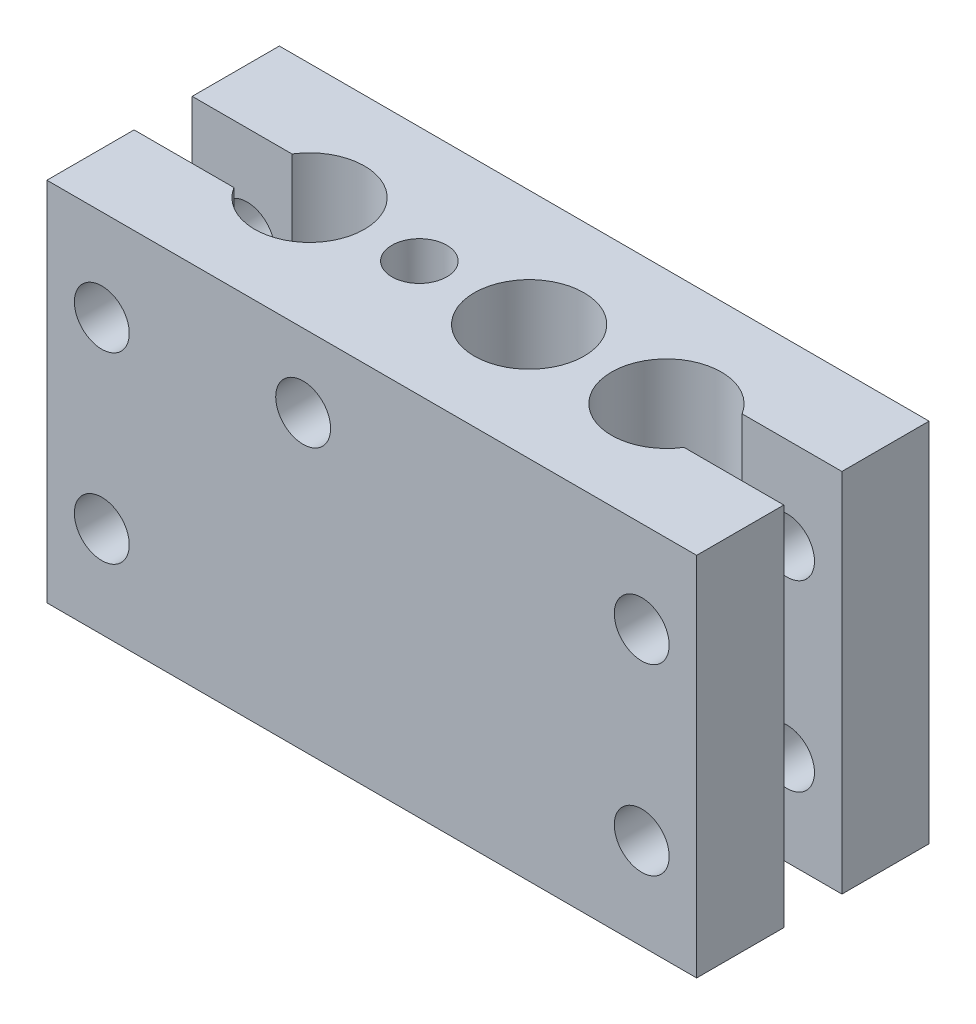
ISO-10303-21;
HEADER;
FILE_DESCRIPTION(('STEP AP214'),'2;1');
FILE_NAME('part.step','',(''),(''),'','','');
FILE_SCHEMA(('AUTOMOTIVE_DESIGN { 1 0 10303 214 1 1 1 1 }'));
ENDSEC;
DATA;
#1=APPLICATION_CONTEXT('core data for automotive mechanical design processes');
#2=APPLICATION_PROTOCOL_DEFINITION('international standard','automotive_design',2000,#1);
#3=PRODUCT_CONTEXT('',#1,'mechanical');
#4=PRODUCT('Part','Part','',(#3));
#5=PRODUCT_RELATED_PRODUCT_CATEGORY('part','',(#4));
#6=PRODUCT_DEFINITION_FORMATION('','',#4);
#7=PRODUCT_DEFINITION_CONTEXT('part definition',#1,'design');
#8=PRODUCT_DEFINITION('design','',#6,#7);
#9=PRODUCT_DEFINITION_SHAPE('','',#8);
#10=(LENGTH_UNIT() NAMED_UNIT(*) SI_UNIT(.MILLI.,.METRE.));
#11=(NAMED_UNIT(*) PLANE_ANGLE_UNIT() SI_UNIT($,.RADIAN.));
#12=(NAMED_UNIT(*) SI_UNIT($,.STERADIAN.) SOLID_ANGLE_UNIT());
#13=UNCERTAINTY_MEASURE_WITH_UNIT(LENGTH_MEASURE(1.E-05),#10,'distance_accuracy_value','');
#14=(GEOMETRIC_REPRESENTATION_CONTEXT(3) GLOBAL_UNCERTAINTY_ASSIGNED_CONTEXT((#13)) GLOBAL_UNIT_ASSIGNED_CONTEXT((#10,
#11,#12)) REPRESENTATION_CONTEXT('',''));
#15=CARTESIAN_POINT('',(0.,0.,0.));
#16=DIRECTION('',(0.,0.,1.));
#17=DIRECTION('',(1.,0.,0.));
#18=AXIS2_PLACEMENT_3D('',#15,#16,#17);
#19=CARTESIAN_POINT('',(-3.75,-10.,0.));
#20=DIRECTION('',(0.,1.,0.));
#21=DIRECTION('',(0.,0.,1.));
#22=AXIS2_PLACEMENT_3D('',#19,#20,#21);
#23=CYLINDRICAL_SURFACE('',#22,1.5);
#24=CARTESIAN_POINT('',(-3.75,10.,0.));
#25=DIRECTION('',(0.,-1.,0.));
#26=DIRECTION('',(0.,0.,-1.));
#27=AXIS2_PLACEMENT_3D('',#24,#25,#26);
#28=CIRCLE('',#27,1.5);
#29=CARTESIAN_POINT('',(-3.75,10.,-1.5));
#30=VERTEX_POINT('',#29);
#31=EDGE_CURVE('E341',#30,#30,#28,.T.);
#32=ORIENTED_EDGE('',*,*,#31,.F.);
#33=EDGE_LOOP('',(#32));
#34=FACE_BOUND('',#33,.T.);
#35=CARTESIAN_POINT('',(-3.75,6.,0.));
#36=DIRECTION('',(0.,0.707106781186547,-0.707106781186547));
#37=DIRECTION('',(0.,0.707106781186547,0.707106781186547));
#38=AXIS2_PLACEMENT_3D('',#35,#36,#37);
#39=ELLIPSE('',#38,2.12132034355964,1.5);
#40=CARTESIAN_POINT('',(-2.25,6.,0.));
#41=VERTEX_POINT('',#40);
#42=CARTESIAN_POINT('',(-5.24999999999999,6.,0.));
#43=VERTEX_POINT('',#42);
#44=EDGE_CURVE('E202',#41,#43,#39,.F.);
#45=ORIENTED_EDGE('',*,*,#44,.T.);
#46=CARTESIAN_POINT('',(-3.75,6.,0.));
#47=DIRECTION('',(0.,0.707106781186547,0.707106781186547));
#48=DIRECTION('',(0.,0.707106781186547,-0.707106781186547));
#49=AXIS2_PLACEMENT_3D('',#46,#47,#48);
#50=ELLIPSE('',#49,2.12132034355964,1.5);
#51=EDGE_CURVE('E12',#43,#41,#50,.F.);
#52=ORIENTED_EDGE('',*,*,#51,.T.);
#53=EDGE_LOOP('',(#45,#52));
#54=FACE_BOUND('',#53,.T.);
#55=ADVANCED_FACE('F189',(#34,#54),#23,.F.);
#56=CARTESIAN_POINT('',(17.75,-10.,6.35));
#57=DIRECTION('',(-1.,0.,0.));
#58=DIRECTION('',(0.,0.,1.));
#59=AXIS2_PLACEMENT_3D('',#56,#57,#58);
#60=PLANE('',#59);
#61=DIRECTION('',(0.,1.,0.));
#62=VECTOR('',#61,1.);
#63=CARTESIAN_POINT('',(17.75,-10.,-1.5875));
#64=LINE('',#63,#62);
#65=CARTESIAN_POINT('',(17.75,-10.,-1.5875));
#66=VERTEX_POINT('',#65);
#67=CARTESIAN_POINT('',(17.75,10.,-1.5875));
#68=VERTEX_POINT('',#67);
#69=EDGE_CURVE('E293',#66,#68,#64,.T.);
#70=ORIENTED_EDGE('',*,*,#69,.F.);
#71=DIRECTION('',(0.,0.,-1.));
#72=VECTOR('',#71,1.);
#73=CARTESIAN_POINT('',(17.75,-10.,6.35));
#74=LINE('',#73,#72);
#75=CARTESIAN_POINT('',(17.75,-10.,-6.35));
#76=VERTEX_POINT('',#75);
#77=EDGE_CURVE('E287',#66,#76,#74,.T.);
#78=ORIENTED_EDGE('',*,*,#77,.T.);
#79=DIRECTION('',(0.,1.,0.));
#80=VECTOR('',#79,1.);
#81=CARTESIAN_POINT('',(17.75,-10.,-6.35));
#82=LINE('',#81,#80);
#83=CARTESIAN_POINT('',(17.75,10.,-6.35));
#84=VERTEX_POINT('',#83);
#85=EDGE_CURVE('E292',#76,#84,#82,.T.);
#86=ORIENTED_EDGE('',*,*,#85,.T.);
#87=DIRECTION('',(0.,0.,-1.));
#88=VECTOR('',#87,1.);
#89=CARTESIAN_POINT('',(17.75,10.,6.35));
#90=LINE('',#89,#88);
#91=EDGE_CURVE('E333',#68,#84,#90,.T.);
#92=ORIENTED_EDGE('',*,*,#91,.F.);
#93=EDGE_LOOP('',(#70,#78,#86,#92));
#94=FACE_BOUND('',#93,.T.);
#95=ADVANCED_FACE('F289',(#94),#60,.F.);
#96=CARTESIAN_POINT('',(-17.75,10.,6.35));
#97=DIRECTION('',(0.,-1.,0.));
#98=DIRECTION('',(0.,0.,-1.));
#99=AXIS2_PLACEMENT_3D('',#96,#97,#98);
#100=PLANE('',#99);
#101=CARTESIAN_POINT('',(2.25,10.,0.));
#102=DIRECTION('',(0.,-1.,0.));
#103=DIRECTION('',(0.,0.,-1.));
#104=AXIS2_PLACEMENT_3D('',#101,#102,#103);
#105=CIRCLE('',#104,3.);
#106=CARTESIAN_POINT('',(2.25,10.,-3.));
#107=VERTEX_POINT('',#106);
#108=EDGE_CURVE('E436',#107,#107,#105,.T.);
#109=ORIENTED_EDGE('',*,*,#108,.T.);
#110=EDGE_LOOP('',(#109));
#111=FACE_BOUND('',#110,.T.);
#112=ORIENTED_EDGE('',*,*,#31,.T.);
#113=EDGE_LOOP('',(#112));
#114=FACE_BOUND('',#113,.T.);
#115=DIRECTION('',(-1.,0.,0.));
#116=VECTOR('',#115,1.);
#117=CARTESIAN_POINT('',(-17.75,10.,-1.5875));
#118=LINE('',#117,#116);
#119=CARTESIAN_POINT('',(12.2955537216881,10.,-1.5875));
#120=VERTEX_POINT('',#119);
#121=EDGE_CURVE('E315',#68,#120,#118,.T.);
#122=ORIENTED_EDGE('',*,*,#121,.F.);
#123=ORIENTED_EDGE('',*,*,#91,.T.);
#124=DIRECTION('',(-1.,0.,0.));
#125=VECTOR('',#124,1.);
#126=CARTESIAN_POINT('',(-17.75,10.,-6.35));
#127=LINE('',#126,#125);
#128=CARTESIAN_POINT('',(-17.75,10.,-6.35));
#129=VERTEX_POINT('',#128);
#130=EDGE_CURVE('E314',#84,#129,#127,.T.);
#131=ORIENTED_EDGE('',*,*,#130,.T.);
#132=DIRECTION('',(0.,0.,-1.));
#133=VECTOR('',#132,1.);
#134=CARTESIAN_POINT('',(-17.75,10.,6.35));
#135=LINE('',#134,#133);
#136=CARTESIAN_POINT('',(-17.75,10.,-1.5875));
#137=VERTEX_POINT('',#136);
#138=EDGE_CURVE('E329',#137,#129,#135,.T.);
#139=ORIENTED_EDGE('',*,*,#138,.F.);
#140=DIRECTION('',(1.,0.,0.));
#141=VECTOR('',#140,1.);
#142=CARTESIAN_POINT('',(-17.75,10.,-1.5875));
#143=LINE('',#142,#141);
#144=CARTESIAN_POINT('',(-12.2955537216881,10.,-1.5875));
#145=VERTEX_POINT('',#144);
#146=EDGE_CURVE('E340',#137,#145,#143,.T.);
#147=ORIENTED_EDGE('',*,*,#146,.T.);
#148=CARTESIAN_POINT('',(-9.75,10.,0.));
#149=DIRECTION('',(0.,1.,0.));
#150=DIRECTION('',(0.,0.,1.));
#151=AXIS2_PLACEMENT_3D('',#148,#149,#150);
#152=CIRCLE('',#151,3.);
#153=CARTESIAN_POINT('',(-12.2955537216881,10.,1.5875));
#154=VERTEX_POINT('',#153);
#155=EDGE_CURVE('E344',#145,#154,#152,.F.);
#156=ORIENTED_EDGE('',*,*,#155,.T.);
#157=DIRECTION('',(1.,0.,0.));
#158=VECTOR('',#157,1.);
#159=CARTESIAN_POINT('',(-17.75,10.,1.5875));
#160=LINE('',#159,#158);
#161=CARTESIAN_POINT('',(-17.75,10.,1.5875));
#162=VERTEX_POINT('',#161);
#163=EDGE_CURVE('E337',#162,#154,#160,.T.);
#164=ORIENTED_EDGE('',*,*,#163,.F.);
#165=CARTESIAN_POINT('',(-17.75,10.,6.35));
#166=VERTEX_POINT('',#165);
#167=EDGE_CURVE('E330',#166,#162,#135,.T.);
#168=ORIENTED_EDGE('',*,*,#167,.F.);
#169=DIRECTION('',(-1.,0.,0.));
#170=VECTOR('',#169,1.);
#171=CARTESIAN_POINT('',(-17.75,10.,6.35));
#172=LINE('',#171,#170);
#173=CARTESIAN_POINT('',(17.75,10.,6.35));
#174=VERTEX_POINT('',#173);
#175=EDGE_CURVE('E481',#174,#166,#172,.T.);
#176=ORIENTED_EDGE('',*,*,#175,.F.);
#177=CARTESIAN_POINT('',(17.75,10.,1.5875));
#178=VERTEX_POINT('',#177);
#179=EDGE_CURVE('E334',#174,#178,#90,.T.);
#180=ORIENTED_EDGE('',*,*,#179,.T.);
#181=DIRECTION('',(-1.,0.,0.));
#182=VECTOR('',#181,1.);
#183=CARTESIAN_POINT('',(-17.75,10.,1.5875));
#184=LINE('',#183,#182);
#185=CARTESIAN_POINT('',(12.2955537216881,10.,1.5875));
#186=VERTEX_POINT('',#185);
#187=EDGE_CURVE('E319',#178,#186,#184,.T.);
#188=ORIENTED_EDGE('',*,*,#187,.T.);
#189=CARTESIAN_POINT('',(9.75,10.,0.));
#190=DIRECTION('',(0.,1.,0.));
#191=DIRECTION('',(0.,0.,1.));
#192=AXIS2_PLACEMENT_3D('',#189,#190,#191);
#193=CIRCLE('',#192,3.);
#194=EDGE_CURVE('E347',#120,#186,#193,.T.);
#195=ORIENTED_EDGE('',*,*,#194,.F.);
#196=EDGE_LOOP('',(#122,#123,#131,#139,#147,#156,#164,#168,#176,#180,#188,#195));
#197=FACE_BOUND('',#196,.T.);
#198=ADVANCED_FACE('F390',(#111,#114,#197),#100,.F.);
#199=CARTESIAN_POINT('',(-17.75,-10.,6.35));
#200=DIRECTION('',(1.,0.,0.));
#201=DIRECTION('',(0.,0.,-1.));
#202=AXIS2_PLACEMENT_3D('',#199,#200,#201);
#203=PLANE('',#202);
#204=DIRECTION('',(0.,1.,0.));
#205=VECTOR('',#204,1.);
#206=CARTESIAN_POINT('',(-17.75,-10.,1.5875));
#207=LINE('',#206,#205);
#208=CARTESIAN_POINT('',(-17.75,-10.,1.5875));
#209=VERTEX_POINT('',#208);
#210=EDGE_CURVE('E494',#209,#162,#207,.T.);
#211=ORIENTED_EDGE('',*,*,#210,.F.);
#212=DIRECTION('',(0.,0.,-1.));
#213=VECTOR('',#212,1.);
#214=CARTESIAN_POINT('',(-17.75,-10.,6.35));
#215=LINE('',#214,#213);
#216=CARTESIAN_POINT('',(-17.75,-10.,6.35));
#217=VERTEX_POINT('',#216);
#218=EDGE_CURVE('E326',#217,#209,#215,.T.);
#219=ORIENTED_EDGE('',*,*,#218,.F.);
#220=DIRECTION('',(0.,-1.,0.));
#221=VECTOR('',#220,1.);
#222=CARTESIAN_POINT('',(-17.75,-10.,6.35));
#223=LINE('',#222,#221);
#224=EDGE_CURVE('E482',#166,#217,#223,.T.);
#225=ORIENTED_EDGE('',*,*,#224,.F.);
#226=ORIENTED_EDGE('',*,*,#167,.T.);
#227=EDGE_LOOP('',(#211,#219,#225,#226));
#228=FACE_BOUND('',#227,.T.);
#229=ADVANCED_FACE('F423',(#228),#203,.F.);
#230=CARTESIAN_POINT('',(-17.75,-10.,6.35));
#231=DIRECTION('',(0.,1.,0.));
#232=DIRECTION('',(0.,0.,1.));
#233=AXIS2_PLACEMENT_3D('',#230,#231,#232);
#234=PLANE('',#233);
#235=CARTESIAN_POINT('',(2.25,-10.,0.));
#236=DIRECTION('',(0.,1.,0.));
#237=DIRECTION('',(0.,0.,1.));
#238=AXIS2_PLACEMENT_3D('',#235,#236,#237);
#239=CIRCLE('',#238,3.);
#240=CARTESIAN_POINT('',(2.25,-10.,3.));
#241=VERTEX_POINT('',#240);
#242=EDGE_CURVE('E467',#241,#241,#239,.T.);
#243=ORIENTED_EDGE('',*,*,#242,.T.);
#244=EDGE_LOOP('',(#243));
#245=FACE_BOUND('',#244,.T.);
#246=CARTESIAN_POINT('',(-3.75,-10.,0.));
#247=DIRECTION('',(0.,1.,0.));
#248=DIRECTION('',(0.,0.,1.));
#249=AXIS2_PLACEMENT_3D('',#246,#247,#248);
#250=CIRCLE('',#249,1.5);
#251=CARTESIAN_POINT('',(-3.75,-10.,1.5));
#252=VERTEX_POINT('',#251);
#253=EDGE_CURVE('E470',#252,#252,#250,.T.);
#254=ORIENTED_EDGE('',*,*,#253,.T.);
#255=EDGE_LOOP('',(#254));
#256=FACE_BOUND('',#255,.T.);
#257=DIRECTION('',(1.,0.,0.));
#258=VECTOR('',#257,1.);
#259=CARTESIAN_POINT('',(0.,-10.,-1.5875));
#260=LINE('',#259,#258);
#261=CARTESIAN_POINT('',(12.2955537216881,-10.,-1.5875));
#262=VERTEX_POINT('',#261);
#263=EDGE_CURVE('E462',#262,#66,#260,.T.);
#264=ORIENTED_EDGE('',*,*,#263,.F.);
#265=CARTESIAN_POINT('',(9.75,-10.,0.));
#266=DIRECTION('',(0.,1.,0.));
#267=DIRECTION('',(0.,0.,1.));
#268=AXIS2_PLACEMENT_3D('',#265,#266,#267);
#269=CIRCLE('',#268,3.);
#270=CARTESIAN_POINT('',(12.2955537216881,-10.,1.5875));
#271=VERTEX_POINT('',#270);
#272=EDGE_CURVE('E449',#262,#271,#269,.T.);
#273=ORIENTED_EDGE('',*,*,#272,.T.);
#274=DIRECTION('',(1.,0.,0.));
#275=VECTOR('',#274,1.);
#276=CARTESIAN_POINT('',(0.,-10.,1.5875));
#277=LINE('',#276,#275);
#278=CARTESIAN_POINT('',(17.75,-10.,1.5875));
#279=VERTEX_POINT('',#278);
#280=EDGE_CURVE('E211',#271,#279,#277,.T.);
#281=ORIENTED_EDGE('',*,*,#280,.T.);
#282=CARTESIAN_POINT('',(17.75,-10.,6.35));
#283=VERTEX_POINT('',#282);
#284=EDGE_CURVE('E296',#283,#279,#74,.T.);
#285=ORIENTED_EDGE('',*,*,#284,.F.);
#286=DIRECTION('',(1.,0.,0.));
#287=VECTOR('',#286,1.);
#288=CARTESIAN_POINT('',(-17.75,-10.,6.35));
#289=LINE('',#288,#287);
#290=EDGE_CURVE('E297',#217,#283,#289,.T.);
#291=ORIENTED_EDGE('',*,*,#290,.F.);
#292=ORIENTED_EDGE('',*,*,#218,.T.);
#293=DIRECTION('',(-1.,0.,0.));
#294=VECTOR('',#293,1.);
#295=CARTESIAN_POINT('',(-12.2955537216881,-10.,1.5875));
#296=LINE('',#295,#294);
#297=CARTESIAN_POINT('',(-12.2955537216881,-10.,1.5875));
#298=VERTEX_POINT('',#297);
#299=EDGE_CURVE('E498',#298,#209,#296,.T.);
#300=ORIENTED_EDGE('',*,*,#299,.F.);
#301=CARTESIAN_POINT('',(-9.75,-10.,0.));
#302=DIRECTION('',(0.,-1.,0.));
#303=DIRECTION('',(0.,0.,-1.));
#304=AXIS2_PLACEMENT_3D('',#301,#302,#303);
#305=CIRCLE('',#304,3.);
#306=CARTESIAN_POINT('',(-12.2955537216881,-10.,-1.5875));
#307=VERTEX_POINT('',#306);
#308=EDGE_CURVE('E478',#307,#298,#305,.T.);
#309=ORIENTED_EDGE('',*,*,#308,.F.);
#310=DIRECTION('',(-1.,0.,0.));
#311=VECTOR('',#310,1.);
#312=CARTESIAN_POINT('',(-12.2955537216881,-10.,-1.5875));
#313=LINE('',#312,#311);
#314=CARTESIAN_POINT('',(-17.75,-10.,-1.5875));
#315=VERTEX_POINT('',#314);
#316=EDGE_CURVE('E504',#307,#315,#313,.T.);
#317=ORIENTED_EDGE('',*,*,#316,.T.);
#318=CARTESIAN_POINT('',(-17.75,-10.,-6.35));
#319=VERTEX_POINT('',#318);
#320=EDGE_CURVE('E304',#315,#319,#215,.T.);
#321=ORIENTED_EDGE('',*,*,#320,.T.);
#322=DIRECTION('',(1.,0.,0.));
#323=VECTOR('',#322,1.);
#324=CARTESIAN_POINT('',(-17.75,-10.,-6.35));
#325=LINE('',#324,#323);
#326=EDGE_CURVE('E300',#319,#76,#325,.T.);
#327=ORIENTED_EDGE('',*,*,#326,.T.);
#328=ORIENTED_EDGE('',*,*,#77,.F.);
#329=EDGE_LOOP('',(#264,#273,#281,#285,#291,#292,#300,#309,#317,#321,#327,#328));
#330=FACE_BOUND('',#329,.T.);
#331=ADVANCED_FACE('F301',(#245,#256,#330),#234,.F.);
#332=ORIENTED_EDGE('',*,*,#284,.T.);
#333=DIRECTION('',(0.,1.,0.));
#334=VECTOR('',#333,1.);
#335=CARTESIAN_POINT('',(17.75,-10.,1.5875));
#336=LINE('',#335,#334);
#337=EDGE_CURVE('E452',#279,#178,#336,.T.);
#338=ORIENTED_EDGE('',*,*,#337,.T.);
#339=ORIENTED_EDGE('',*,*,#179,.F.);
#340=DIRECTION('',(0.,1.,0.));
#341=VECTOR('',#340,1.);
#342=CARTESIAN_POINT('',(17.75,-10.,6.35));
#343=LINE('',#342,#341);
#344=EDGE_CURVE('E308',#283,#174,#343,.T.);
#345=ORIENTED_EDGE('',*,*,#344,.F.);
#346=EDGE_LOOP('',(#332,#338,#339,#345));
#347=FACE_BOUND('',#346,.T.);
#348=ADVANCED_FACE('F191',(#347),#60,.F.);
#349=ORIENTED_EDGE('',*,*,#320,.F.);
#350=DIRECTION('',(0.,1.,0.));
#351=VECTOR('',#350,1.);
#352=CARTESIAN_POINT('',(-17.75,-10.,-1.5875));
#353=LINE('',#352,#351);
#354=EDGE_CURVE('E503',#315,#137,#353,.T.);
#355=ORIENTED_EDGE('',*,*,#354,.T.);
#356=ORIENTED_EDGE('',*,*,#138,.T.);
#357=DIRECTION('',(0.,-1.,0.));
#358=VECTOR('',#357,1.);
#359=CARTESIAN_POINT('',(-17.75,-10.,-6.35));
#360=LINE('',#359,#358);
#361=EDGE_CURVE('E309',#129,#319,#360,.T.);
#362=ORIENTED_EDGE('',*,*,#361,.T.);
#363=EDGE_LOOP('',(#349,#355,#356,#362));
#364=FACE_BOUND('',#363,.T.);
#365=ADVANCED_FACE('F418',(#364),#203,.F.);
#366=CARTESIAN_POINT('',(0.,0.,6.35));
#367=DIRECTION('',(0.,0.,-1.));
#368=DIRECTION('',(-1.,0.,0.));
#369=AXIS2_PLACEMENT_3D('',#366,#367,#368);
#370=PLANE('',#369);
#371=CARTESIAN_POINT('',(-14.75,5.,6.35));
#372=DIRECTION('',(0.,0.,-1.));
#373=DIRECTION('',(-1.,0.,0.));
#374=AXIS2_PLACEMENT_3D('',#371,#372,#373);
#375=CIRCLE('',#374,1.5);
#376=CARTESIAN_POINT('',(-16.25,5.,6.35));
#377=VERTEX_POINT('',#376);
#378=EDGE_CURVE('E456',#377,#377,#375,.T.);
#379=ORIENTED_EDGE('',*,*,#378,.T.);
#380=EDGE_LOOP('',(#379));
#381=FACE_BOUND('',#380,.T.);
#382=CARTESIAN_POINT('',(-14.75,-5.,6.35));
#383=DIRECTION('',(0.,0.,-1.));
#384=DIRECTION('',(-1.,0.,0.));
#385=AXIS2_PLACEMENT_3D('',#382,#383,#384);
#386=CIRCLE('',#385,1.5);
#387=CARTESIAN_POINT('',(-16.25,-5.,6.35));
#388=VERTEX_POINT('',#387);
#389=EDGE_CURVE('E368',#388,#388,#386,.T.);
#390=ORIENTED_EDGE('',*,*,#389,.T.);
#391=EDGE_LOOP('',(#390));
#392=FACE_BOUND('',#391,.T.);
#393=CARTESIAN_POINT('',(-3.74999999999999,6.,6.35));
#394=DIRECTION('',(0.,0.,-1.));
#395=DIRECTION('',(-1.,0.,0.));
#396=AXIS2_PLACEMENT_3D('',#393,#394,#395);
#397=CIRCLE('',#396,1.5);
#398=CARTESIAN_POINT('',(-5.24999999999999,6.,6.35));
#399=VERTEX_POINT('',#398);
#400=EDGE_CURVE('E450',#399,#399,#397,.T.);
#401=ORIENTED_EDGE('',*,*,#400,.T.);
#402=EDGE_LOOP('',(#401));
#403=FACE_BOUND('',#402,.T.);
#404=CARTESIAN_POINT('',(14.75,-5.,6.35));
#405=DIRECTION('',(0.,0.,-1.));
#406=DIRECTION('',(-1.,0.,0.));
#407=AXIS2_PLACEMENT_3D('',#404,#405,#406);
#408=CIRCLE('',#407,1.5);
#409=CARTESIAN_POINT('',(13.25,-5.,6.35));
#410=VERTEX_POINT('',#409);
#411=EDGE_CURVE('E363',#410,#410,#408,.T.);
#412=ORIENTED_EDGE('',*,*,#411,.T.);
#413=EDGE_LOOP('',(#412));
#414=FACE_BOUND('',#413,.T.);
#415=CARTESIAN_POINT('',(14.75,5.,6.35));
#416=DIRECTION('',(0.,0.,-1.));
#417=DIRECTION('',(-1.,0.,0.));
#418=AXIS2_PLACEMENT_3D('',#415,#416,#417);
#419=CIRCLE('',#418,1.5);
#420=CARTESIAN_POINT('',(13.25,5.,6.35));
#421=VERTEX_POINT('',#420);
#422=EDGE_CURVE('E358',#421,#421,#419,.T.);
#423=ORIENTED_EDGE('',*,*,#422,.T.);
#424=EDGE_LOOP('',(#423));
#425=FACE_BOUND('',#424,.T.);
#426=ORIENTED_EDGE('',*,*,#344,.T.);
#427=ORIENTED_EDGE('',*,*,#175,.T.);
#428=ORIENTED_EDGE('',*,*,#224,.T.);
#429=ORIENTED_EDGE('',*,*,#290,.T.);
#430=EDGE_LOOP('',(#426,#427,#428,#429));
#431=FACE_BOUND('',#430,.T.);
#432=ADVANCED_FACE('F408',(#381,#392,#403,#414,#425,#431),#370,.F.);
#433=CARTESIAN_POINT('',(0.,0.,-6.35));
#434=DIRECTION('',(0.,0.,-1.));
#435=DIRECTION('',(-1.,0.,0.));
#436=AXIS2_PLACEMENT_3D('',#433,#434,#435);
#437=PLANE('',#436);
#438=CARTESIAN_POINT('',(-14.75,5.,-6.35));
#439=DIRECTION('',(0.,0.,1.));
#440=DIRECTION('',(-1.,0.,0.));
#441=AXIS2_PLACEMENT_3D('',#438,#439,#440);
#442=CIRCLE('',#441,1.5);
#443=CARTESIAN_POINT('',(-16.25,5.,-6.35));
#444=VERTEX_POINT('',#443);
#445=EDGE_CURVE('E533',#444,#444,#442,.T.);
#446=ORIENTED_EDGE('',*,*,#445,.T.);
#447=EDGE_LOOP('',(#446));
#448=FACE_BOUND('',#447,.T.);
#449=CARTESIAN_POINT('',(-14.75,-5.,-6.35));
#450=DIRECTION('',(0.,0.,1.));
#451=DIRECTION('',(-1.,0.,0.));
#452=AXIS2_PLACEMENT_3D('',#449,#450,#451);
#453=CIRCLE('',#452,1.5);
#454=CARTESIAN_POINT('',(-16.25,-5.,-6.35));
#455=VERTEX_POINT('',#454);
#456=EDGE_CURVE('E536',#455,#455,#453,.T.);
#457=ORIENTED_EDGE('',*,*,#456,.T.);
#458=EDGE_LOOP('',(#457));
#459=FACE_BOUND('',#458,.T.);
#460=CARTESIAN_POINT('',(-3.74999999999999,6.,-6.35));
#461=DIRECTION('',(0.,0.,1.));
#462=DIRECTION('',(1.,0.,0.));
#463=AXIS2_PLACEMENT_3D('',#460,#461,#462);
#464=CIRCLE('',#463,1.5);
#465=CARTESIAN_POINT('',(-2.24999999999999,6.,-6.35));
#466=VERTEX_POINT('',#465);
#467=EDGE_CURVE('E539',#466,#466,#464,.T.);
#468=ORIENTED_EDGE('',*,*,#467,.T.);
#469=EDGE_LOOP('',(#468));
#470=FACE_BOUND('',#469,.T.);
#471=CARTESIAN_POINT('',(14.75,-5.,-6.35));
#472=DIRECTION('',(0.,0.,1.));
#473=DIRECTION('',(1.,0.,0.));
#474=AXIS2_PLACEMENT_3D('',#471,#472,#473);
#475=CIRCLE('',#474,1.5);
#476=CARTESIAN_POINT('',(16.25,-5.,-6.35));
#477=VERTEX_POINT('',#476);
#478=EDGE_CURVE('E532',#477,#477,#475,.T.);
#479=ORIENTED_EDGE('',*,*,#478,.T.);
#480=EDGE_LOOP('',(#479));
#481=FACE_BOUND('',#480,.T.);
#482=CARTESIAN_POINT('',(14.75,5.,-6.35));
#483=DIRECTION('',(0.,0.,1.));
#484=DIRECTION('',(1.,0.,0.));
#485=AXIS2_PLACEMENT_3D('',#482,#483,#484);
#486=CIRCLE('',#485,1.5);
#487=CARTESIAN_POINT('',(16.25,5.,-6.35));
#488=VERTEX_POINT('',#487);
#489=EDGE_CURVE('E353',#488,#488,#486,.T.);
#490=ORIENTED_EDGE('',*,*,#489,.T.);
#491=EDGE_LOOP('',(#490));
#492=FACE_BOUND('',#491,.T.);
#493=ORIENTED_EDGE('',*,*,#85,.F.);
#494=ORIENTED_EDGE('',*,*,#326,.F.);
#495=ORIENTED_EDGE('',*,*,#361,.F.);
#496=ORIENTED_EDGE('',*,*,#130,.F.);
#497=EDGE_LOOP('',(#493,#494,#495,#496));
#498=FACE_BOUND('',#497,.T.);
#499=ADVANCED_FACE('F312',(#448,#459,#470,#481,#492,#498),#437,.T.);
#500=CARTESIAN_POINT('',(2.25,-10.,0.));
#501=DIRECTION('',(0.,1.,0.));
#502=DIRECTION('',(0.,0.,1.));
#503=AXIS2_PLACEMENT_3D('',#500,#501,#502);
#504=CYLINDRICAL_SURFACE('',#503,3.);
#505=ORIENTED_EDGE('',*,*,#242,.F.);
#506=EDGE_LOOP('',(#505));
#507=FACE_BOUND('',#506,.T.);
#508=ORIENTED_EDGE('',*,*,#108,.F.);
#509=EDGE_LOOP('',(#508));
#510=FACE_BOUND('',#509,.T.);
#511=ADVANCED_FACE('F396',(#507,#510),#504,.F.);
#512=CARTESIAN_POINT('',(-3.75,6.,0.));
#513=DIRECTION('',(0.,0.707106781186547,-0.707106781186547));
#514=DIRECTION('',(0.,0.707106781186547,0.707106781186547));
#515=AXIS2_PLACEMENT_3D('',#512,#513,#514);
#516=ELLIPSE('',#515,2.12132034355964,1.5);
#517=EDGE_CURVE('E370',#41,#43,#516,.T.);
#518=ORIENTED_EDGE('',*,*,#517,.T.);
#519=CARTESIAN_POINT('',(-3.75,6.,0.));
#520=DIRECTION('',(0.,0.707106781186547,0.707106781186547));
#521=DIRECTION('',(0.,0.707106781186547,-0.707106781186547));
#522=AXIS2_PLACEMENT_3D('',#519,#520,#521);
#523=ELLIPSE('',#522,2.12132034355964,1.5);
#524=EDGE_CURVE('E197',#43,#41,#523,.T.);
#525=ORIENTED_EDGE('',*,*,#524,.T.);
#526=EDGE_LOOP('',(#518,#525));
#527=FACE_BOUND('',#526,.T.);
#528=ORIENTED_EDGE('',*,*,#253,.F.);
#529=EDGE_LOOP('',(#528));
#530=FACE_BOUND('',#529,.T.);
#531=ADVANCED_FACE('F374',(#527,#530),#23,.F.);
#532=CARTESIAN_POINT('',(-9.75,-10.,0.));
#533=DIRECTION('',(0.,1.,0.));
#534=DIRECTION('',(0.,0.,1.));
#535=AXIS2_PLACEMENT_3D('',#532,#533,#534);
#536=CYLINDRICAL_SURFACE('',#535,3.);
#537=ORIENTED_EDGE('',*,*,#155,.F.);
#538=DIRECTION('',(0.,1.,0.));
#539=VECTOR('',#538,1.);
#540=CARTESIAN_POINT('',(-12.2955537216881,-10.,-1.5875));
#541=LINE('',#540,#539);
#542=EDGE_CURVE('E239',#307,#145,#541,.T.);
#543=ORIENTED_EDGE('',*,*,#542,.F.);
#544=ORIENTED_EDGE('',*,*,#308,.T.);
#545=DIRECTION('',(0.,1.,0.));
#546=VECTOR('',#545,1.);
#547=CARTESIAN_POINT('',(-12.2955537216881,-10.,1.5875));
#548=LINE('',#547,#546);
#549=EDGE_CURVE('E475',#154,#298,#548,.F.);
#550=ORIENTED_EDGE('',*,*,#549,.F.);
#551=EDGE_LOOP('',(#537,#543,#544,#550));
#552=FACE_BOUND('',#551,.T.);
#553=ADVANCED_FACE('F395',(#552),#536,.F.);
#554=CARTESIAN_POINT('',(-12.2955537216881,-10.,-1.5875));
#555=DIRECTION('',(0.,0.,-1.));
#556=DIRECTION('',(-1.,0.,0.));
#557=AXIS2_PLACEMENT_3D('',#554,#555,#556);
#558=PLANE('',#557);
#559=CARTESIAN_POINT('',(-14.75,5.,-1.5875));
#560=DIRECTION('',(0.,0.,-1.));
#561=DIRECTION('',(-1.,0.,0.));
#562=AXIS2_PLACEMENT_3D('',#559,#560,#561);
#563=CIRCLE('',#562,1.5);
#564=CARTESIAN_POINT('',(-16.25,5.,-1.5875));
#565=VERTEX_POINT('',#564);
#566=EDGE_CURVE('E367',#565,#565,#563,.T.);
#567=ORIENTED_EDGE('',*,*,#566,.T.);
#568=EDGE_LOOP('',(#567));
#569=FACE_BOUND('',#568,.T.);
#570=CARTESIAN_POINT('',(-14.75,-5.,-1.5875));
#571=DIRECTION('',(0.,0.,-1.));
#572=DIRECTION('',(-1.,0.,0.));
#573=AXIS2_PLACEMENT_3D('',#570,#571,#572);
#574=CIRCLE('',#573,1.5);
#575=CARTESIAN_POINT('',(-16.25,-5.,-1.5875));
#576=VERTEX_POINT('',#575);
#577=EDGE_CURVE('E362',#576,#576,#574,.T.);
#578=ORIENTED_EDGE('',*,*,#577,.T.);
#579=EDGE_LOOP('',(#578));
#580=FACE_BOUND('',#579,.T.);
#581=ORIENTED_EDGE('',*,*,#354,.F.);
#582=ORIENTED_EDGE('',*,*,#316,.F.);
#583=ORIENTED_EDGE('',*,*,#542,.T.);
#584=ORIENTED_EDGE('',*,*,#146,.F.);
#585=EDGE_LOOP('',(#581,#582,#583,#584));
#586=FACE_BOUND('',#585,.T.);
#587=ADVANCED_FACE('F401',(#569,#580,#586),#558,.F.);
#588=CARTESIAN_POINT('',(-12.2955537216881,-10.,1.5875));
#589=DIRECTION('',(0.,0.,-1.));
#590=DIRECTION('',(-1.,0.,0.));
#591=AXIS2_PLACEMENT_3D('',#588,#589,#590);
#592=PLANE('',#591);
#593=CARTESIAN_POINT('',(-14.75,5.,1.5875));
#594=DIRECTION('',(0.,0.,-1.));
#595=DIRECTION('',(-1.,0.,0.));
#596=AXIS2_PLACEMENT_3D('',#593,#594,#595);
#597=CIRCLE('',#596,1.5);
#598=CARTESIAN_POINT('',(-16.25,5.,1.5875));
#599=VERTEX_POINT('',#598);
#600=EDGE_CURVE('E364',#599,#599,#597,.T.);
#601=ORIENTED_EDGE('',*,*,#600,.F.);
#602=EDGE_LOOP('',(#601));
#603=FACE_BOUND('',#602,.T.);
#604=CARTESIAN_POINT('',(-14.75,-5.,1.5875));
#605=DIRECTION('',(0.,0.,-1.));
#606=DIRECTION('',(-1.,0.,0.));
#607=AXIS2_PLACEMENT_3D('',#604,#605,#606);
#608=CIRCLE('',#607,1.5);
#609=CARTESIAN_POINT('',(-16.25,-5.,1.5875));
#610=VERTEX_POINT('',#609);
#611=EDGE_CURVE('E359',#610,#610,#608,.T.);
#612=ORIENTED_EDGE('',*,*,#611,.F.);
#613=EDGE_LOOP('',(#612));
#614=FACE_BOUND('',#613,.T.);
#615=ORIENTED_EDGE('',*,*,#163,.T.);
#616=ORIENTED_EDGE('',*,*,#549,.T.);
#617=ORIENTED_EDGE('',*,*,#299,.T.);
#618=ORIENTED_EDGE('',*,*,#210,.T.);
#619=EDGE_LOOP('',(#615,#616,#617,#618));
#620=FACE_BOUND('',#619,.T.);
#621=ADVANCED_FACE('F588',(#603,#614,#620),#592,.T.);
#622=CARTESIAN_POINT('',(0.,-10.,-1.5875));
#623=DIRECTION('',(0.,0.,1.));
#624=DIRECTION('',(1.,0.,0.));
#625=AXIS2_PLACEMENT_3D('',#622,#623,#624);
#626=PLANE('',#625);
#627=CARTESIAN_POINT('',(14.75,-5.,-1.5875));
#628=DIRECTION('',(0.,0.,1.));
#629=DIRECTION('',(1.,0.,0.));
#630=AXIS2_PLACEMENT_3D('',#627,#628,#629);
#631=CIRCLE('',#630,1.5);
#632=CARTESIAN_POINT('',(16.25,-5.,-1.5875));
#633=VERTEX_POINT('',#632);
#634=EDGE_CURVE('E357',#633,#633,#631,.T.);
#635=ORIENTED_EDGE('',*,*,#634,.F.);
#636=EDGE_LOOP('',(#635));
#637=FACE_BOUND('',#636,.T.);
#638=CARTESIAN_POINT('',(14.75,5.,-1.5875));
#639=DIRECTION('',(0.,0.,1.));
#640=DIRECTION('',(1.,0.,0.));
#641=AXIS2_PLACEMENT_3D('',#638,#639,#640);
#642=CIRCLE('',#641,1.5);
#643=CARTESIAN_POINT('',(16.25,5.,-1.5875));
#644=VERTEX_POINT('',#643);
#645=EDGE_CURVE('E352',#644,#644,#642,.T.);
#646=ORIENTED_EDGE('',*,*,#645,.F.);
#647=EDGE_LOOP('',(#646));
#648=FACE_BOUND('',#647,.T.);
#649=ORIENTED_EDGE('',*,*,#121,.T.);
#650=DIRECTION('',(0.,1.,0.));
#651=VECTOR('',#650,1.);
#652=CARTESIAN_POINT('',(12.2955537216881,-10.,-1.5875));
#653=LINE('',#652,#651);
#654=EDGE_CURVE('E444',#262,#120,#653,.T.);
#655=ORIENTED_EDGE('',*,*,#654,.F.);
#656=ORIENTED_EDGE('',*,*,#263,.T.);
#657=ORIENTED_EDGE('',*,*,#69,.T.);
#658=EDGE_LOOP('',(#649,#655,#656,#657));
#659=FACE_BOUND('',#658,.T.);
#660=ADVANCED_FACE('F415',(#637,#648,#659),#626,.T.);
#661=CARTESIAN_POINT('',(0.,-10.,1.5875));
#662=DIRECTION('',(0.,0.,1.));
#663=DIRECTION('',(1.,0.,0.));
#664=AXIS2_PLACEMENT_3D('',#661,#662,#663);
#665=PLANE('',#664);
#666=CARTESIAN_POINT('',(14.75,-5.,1.5875));
#667=DIRECTION('',(0.,0.,1.));
#668=DIRECTION('',(1.,0.,0.));
#669=AXIS2_PLACEMENT_3D('',#666,#667,#668);
#670=CIRCLE('',#669,1.5);
#671=CARTESIAN_POINT('',(16.25,-5.,1.5875));
#672=VERTEX_POINT('',#671);
#673=EDGE_CURVE('E354',#672,#672,#670,.T.);
#674=ORIENTED_EDGE('',*,*,#673,.T.);
#675=EDGE_LOOP('',(#674));
#676=FACE_BOUND('',#675,.T.);
#677=CARTESIAN_POINT('',(14.75,5.,1.5875));
#678=DIRECTION('',(0.,0.,1.));
#679=DIRECTION('',(1.,0.,0.));
#680=AXIS2_PLACEMENT_3D('',#677,#678,#679);
#681=CIRCLE('',#680,1.5);
#682=CARTESIAN_POINT('',(16.25,5.,1.5875));
#683=VERTEX_POINT('',#682);
#684=EDGE_CURVE('E349',#683,#683,#681,.T.);
#685=ORIENTED_EDGE('',*,*,#684,.T.);
#686=EDGE_LOOP('',(#685));
#687=FACE_BOUND('',#686,.T.);
#688=ORIENTED_EDGE('',*,*,#337,.F.);
#689=ORIENTED_EDGE('',*,*,#280,.F.);
#690=DIRECTION('',(0.,1.,0.));
#691=VECTOR('',#690,1.);
#692=CARTESIAN_POINT('',(12.2955537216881,-10.,1.5875));
#693=LINE('',#692,#691);
#694=EDGE_CURVE('E233',#271,#186,#693,.T.);
#695=ORIENTED_EDGE('',*,*,#694,.T.);
#696=ORIENTED_EDGE('',*,*,#187,.F.);
#697=EDGE_LOOP('',(#688,#689,#695,#696));
#698=FACE_BOUND('',#697,.T.);
#699=ADVANCED_FACE('F579',(#676,#687,#698),#665,.F.);
#700=CARTESIAN_POINT('',(9.75,-10.,0.));
#701=DIRECTION('',(0.,1.,0.));
#702=DIRECTION('',(0.,0.,1.));
#703=AXIS2_PLACEMENT_3D('',#700,#701,#702);
#704=CYLINDRICAL_SURFACE('',#703,3.);
#705=ORIENTED_EDGE('',*,*,#694,.F.);
#706=ORIENTED_EDGE('',*,*,#272,.F.);
#707=ORIENTED_EDGE('',*,*,#654,.T.);
#708=ORIENTED_EDGE('',*,*,#194,.T.);
#709=EDGE_LOOP('',(#705,#706,#707,#708));
#710=FACE_BOUND('',#709,.T.);
#711=ADVANCED_FACE('F447',(#710),#704,.F.);
#712=CARTESIAN_POINT('',(14.75,5.,-6.35));
#713=DIRECTION('',(0.,0.,1.));
#714=DIRECTION('',(1.,0.,0.));
#715=AXIS2_PLACEMENT_3D('',#712,#713,#714);
#716=CYLINDRICAL_SURFACE('',#715,1.5);
#717=ORIENTED_EDGE('',*,*,#684,.F.);
#718=EDGE_LOOP('',(#717));
#719=FACE_BOUND('',#718,.T.);
#720=ORIENTED_EDGE('',*,*,#422,.F.);
#721=EDGE_LOOP('',(#720));
#722=FACE_BOUND('',#721,.T.);
#723=ADVANCED_FACE('F563',(#719,#722),#716,.F.);
#724=CARTESIAN_POINT('',(14.75,-5.,-6.35));
#725=DIRECTION('',(0.,0.,1.));
#726=DIRECTION('',(1.,0.,0.));
#727=AXIS2_PLACEMENT_3D('',#724,#725,#726);
#728=CYLINDRICAL_SURFACE('',#727,1.5);
#729=ORIENTED_EDGE('',*,*,#673,.F.);
#730=EDGE_LOOP('',(#729));
#731=FACE_BOUND('',#730,.T.);
#732=ORIENTED_EDGE('',*,*,#411,.F.);
#733=EDGE_LOOP('',(#732));
#734=FACE_BOUND('',#733,.T.);
#735=ADVANCED_FACE('F553',(#731,#734),#728,.F.);
#736=ORIENTED_EDGE('',*,*,#645,.T.);
#737=EDGE_LOOP('',(#736));
#738=FACE_BOUND('',#737,.T.);
#739=ORIENTED_EDGE('',*,*,#489,.F.);
#740=EDGE_LOOP('',(#739));
#741=FACE_BOUND('',#740,.T.);
#742=ADVANCED_FACE('F550',(#738,#741),#716,.F.);
#743=ORIENTED_EDGE('',*,*,#634,.T.);
#744=EDGE_LOOP('',(#743));
#745=FACE_BOUND('',#744,.T.);
#746=ORIENTED_EDGE('',*,*,#478,.F.);
#747=EDGE_LOOP('',(#746));
#748=FACE_BOUND('',#747,.T.);
#749=ADVANCED_FACE('F547',(#745,#748),#728,.F.);
#750=CARTESIAN_POINT('',(-14.75,-5.,-6.35));
#751=DIRECTION('',(0.,0.,1.));
#752=DIRECTION('',(1.,0.,0.));
#753=AXIS2_PLACEMENT_3D('',#750,#751,#752);
#754=CYLINDRICAL_SURFACE('',#753,1.5);
#755=ORIENTED_EDGE('',*,*,#611,.T.);
#756=EDGE_LOOP('',(#755));
#757=FACE_BOUND('',#756,.T.);
#758=ORIENTED_EDGE('',*,*,#389,.F.);
#759=EDGE_LOOP('',(#758));
#760=FACE_BOUND('',#759,.T.);
#761=ADVANCED_FACE('F549',(#757,#760),#754,.F.);
#762=CARTESIAN_POINT('',(-14.75,5.,-6.35));
#763=DIRECTION('',(0.,0.,1.));
#764=DIRECTION('',(1.,0.,0.));
#765=AXIS2_PLACEMENT_3D('',#762,#763,#764);
#766=CYLINDRICAL_SURFACE('',#765,1.5);
#767=ORIENTED_EDGE('',*,*,#600,.T.);
#768=EDGE_LOOP('',(#767));
#769=FACE_BOUND('',#768,.T.);
#770=ORIENTED_EDGE('',*,*,#378,.F.);
#771=EDGE_LOOP('',(#770));
#772=FACE_BOUND('',#771,.T.);
#773=ADVANCED_FACE('F558',(#769,#772),#766,.F.);
#774=ORIENTED_EDGE('',*,*,#456,.F.);
#775=EDGE_LOOP('',(#774));
#776=FACE_BOUND('',#775,.T.);
#777=ORIENTED_EDGE('',*,*,#577,.F.);
#778=EDGE_LOOP('',(#777));
#779=FACE_BOUND('',#778,.T.);
#780=ADVANCED_FACE('F561',(#776,#779),#754,.F.);
#781=ORIENTED_EDGE('',*,*,#445,.F.);
#782=EDGE_LOOP('',(#781));
#783=FACE_BOUND('',#782,.T.);
#784=ORIENTED_EDGE('',*,*,#566,.F.);
#785=EDGE_LOOP('',(#784));
#786=FACE_BOUND('',#785,.T.);
#787=ADVANCED_FACE('F606',(#783,#786),#766,.F.);
#788=CARTESIAN_POINT('',(-3.74999999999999,6.,-6.35));
#789=DIRECTION('',(0.,0.,1.));
#790=DIRECTION('',(1.,0.,0.));
#791=AXIS2_PLACEMENT_3D('',#788,#789,#790);
#792=CYLINDRICAL_SURFACE('',#791,1.5);
#793=ORIENTED_EDGE('',*,*,#44,.F.);
#794=ORIENTED_EDGE('',*,*,#524,.F.);
#795=EDGE_LOOP('',(#793,#794));
#796=FACE_BOUND('',#795,.T.);
#797=ORIENTED_EDGE('',*,*,#400,.F.);
#798=EDGE_LOOP('',(#797));
#799=FACE_BOUND('',#798,.T.);
#800=ADVANCED_FACE('F380',(#796,#799),#792,.F.);
#801=ORIENTED_EDGE('',*,*,#467,.F.);
#802=EDGE_LOOP('',(#801));
#803=FACE_BOUND('',#802,.T.);
#804=ORIENTED_EDGE('',*,*,#517,.F.);
#805=ORIENTED_EDGE('',*,*,#51,.F.);
#806=EDGE_LOOP('',(#804,#805));
#807=FACE_BOUND('',#806,.T.);
#808=ADVANCED_FACE('F383',(#803,#807),#792,.F.);
#809=CLOSED_SHELL('',(#55,#95,#198,#229,#331,#348,#365,#432,#499,#511,#531,#553,#587,#621,#660,
#699,#711,#723,#735,#742,#749,#761,#773,#780,#787,#800,#808));
#810=MANIFOLD_SOLID_BREP('B2',#809);
#811=ADVANCED_BREP_SHAPE_REPRESENTATION('',(#18,#810),#14);
#812=SHAPE_DEFINITION_REPRESENTATION(#9,#811);
ENDSEC;
END-ISO-10303-21;
